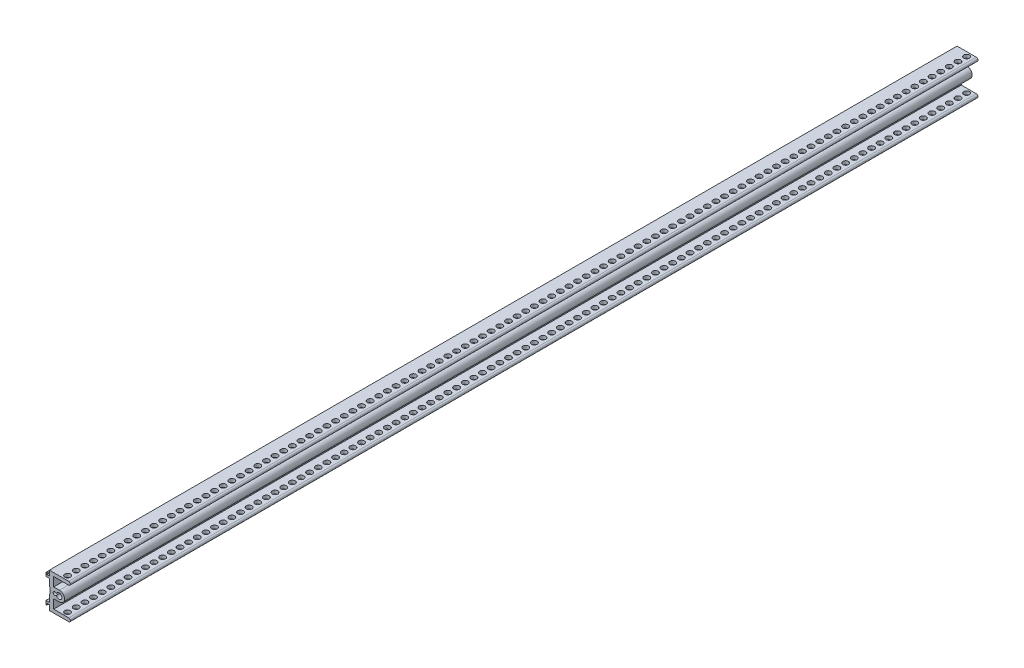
from build123d import *

# Parameters (mm, degrees)
EXTRUDE_1_DEPTH     = 266.7
SKETCH_3_R          = 1.65
CUT_EXTRUDE_1_DEPTH = 2.5


with BuildPart() as part:
    # Sketch 1 → Extrude 1 (new, symmetric)
    with BuildSketch(Plane.XY):
        with BuildLine():
            Line((-4.15, 8.3), (-4.15, 3))
            Line((-4.15, 3), (-0.75, 3))
            ThreePointArc((-0.75, 3), (2.25, 0), (-0.75, -3))
            Line((-0.75, -3), (-4.15, -3))
            Line((-4.15, -3), (-4.15, -8.3))
            Line((-4.15, -8.3), (4.65, -8.3))
            ThreePointArc((4.65, -8.3), (5.65, -9.3), (4.65, -10.3))
            Line((4.65, -10.3), (-6.65, -10.3))
            Line((-6.65, -10.3), (-6.65, -7.3))
            Line((-6.65, -7.3), (-8.05, -7.3))
            Line((-8.05, -7.3), (-8.05, -8.078245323))
            ThreePointArc((-8.05, -8.078245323), (-8.35, -8.378245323), (-8.65, -8.078245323))
            Line((-8.65, -8.078245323), (-8.65, -6.1))
            Line((-8.65, -6.1), (-6.65, -6.1))
            Line((-6.65, -6.1), (-6.65, -2.088438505))
            Line((-6.65, -2.088438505), (-6.35, -1.488438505))
            Line((-6.35, -1.488438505), (-6.35, 1.511561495))
            Line((-6.35, 1.511561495), (-6.65, 2.111561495))
            Line((-6.65, 2.111561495), (-6.65, 6.1))
            Line((-6.65, 6.1), (-8.65, 6.1))
            Line((-8.65, 6.1), (-8.65, 8.078245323))
            ThreePointArc((-8.65, 8.078245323), (-8.35, 8.378245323), (-8.05, 8.078245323))
            Line((-8.05, 8.078245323), (-8.05, 7.3))
            Line((-8.05, 7.3), (-6.65, 7.3))
            Line((-6.65, 7.3), (-6.65, 10.3))
            Line((-6.65, 10.3), (4.65, 10.3))
            ThreePointArc((4.65, 10.3), (5.65, 9.3), (4.65, 8.3))
            Line((4.65, 8.3), (-4.15, 8.3))
        make_face()
        with BuildLine():
            ThreePointArc((-2.5445, -0.424346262), (0.7, 0), (-2.5445, 0.424346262))
            ThreePointArc((-2.5445, 0.424346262), (-4.45, 0), (-2.5445, -0.424346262))
        make_face(mode=Mode.SUBTRACT)
    extrude(amount=EXTRUDE_1_DEPTH, both=True)

    # Sketch 3 → Cut-Extrude 1 (cut)
    with BuildSketch(Plane.XZ.offset(10.3)):
        with Locations((1.5, 264.16)):
            Circle(SKETCH_3_R)
        with Locations((1.5, 259.08)):
            Circle(SKETCH_3_R)
        with Locations((1.5, 254)):
            Circle(SKETCH_3_R)
        with Locations((1.5, 248.92)):
            Circle(SKETCH_3_R)
        with Locations((1.5, 243.84)):
            Circle(SKETCH_3_R)
        with Locations((1.5, 238.76)):
            Circle(SKETCH_3_R)
        with Locations((1.5, 233.68)):
            Circle(SKETCH_3_R)
        with Locations((1.5, 228.6)):
            Circle(SKETCH_3_R)
        with Locations((1.5, 223.52)):
            Circle(SKETCH_3_R)
        with Locations((1.5, 218.44)):
            Circle(SKETCH_3_R)
        with Locations((1.5, 213.36)):
            Circle(SKETCH_3_R)
        with Locations((1.5, 208.28)):
            Circle(SKETCH_3_R)
        with Locations((1.5, 203.2)):
            Circle(SKETCH_3_R)
        with Locations((1.5, 198.12)):
            Circle(SKETCH_3_R)
        with Locations((1.5, 193.04)):
            Circle(SKETCH_3_R)
        with Locations((1.5, 187.96)):
            Circle(SKETCH_3_R)
        with Locations((1.5, 182.88)):
            Circle(SKETCH_3_R)
        with Locations((1.5, 177.8)):
            Circle(SKETCH_3_R)
        with Locations((1.5, 172.72)):
            Circle(SKETCH_3_R)
        with Locations((1.5, 167.64)):
            Circle(SKETCH_3_R)
        with Locations((1.5, 162.56)):
            Circle(SKETCH_3_R)
        with Locations((1.5, 157.48)):
            Circle(SKETCH_3_R)
        with Locations((1.5, 152.4)):
            Circle(SKETCH_3_R)
        with Locations((1.5, 147.32)):
            Circle(SKETCH_3_R)
        with Locations((1.5, 142.24)):
            Circle(SKETCH_3_R)
        with Locations((1.5, 137.16)):
            Circle(SKETCH_3_R)
        with Locations((1.5, 132.08)):
            Circle(SKETCH_3_R)
        with Locations((1.5, 127)):
            Circle(SKETCH_3_R)
        with Locations((1.5, 121.92)):
            Circle(SKETCH_3_R)
        with Locations((1.5, 116.84)):
            Circle(SKETCH_3_R)
        with Locations((1.5, 111.76)):
            Circle(SKETCH_3_R)
        with Locations((1.5, 106.68)):
            Circle(SKETCH_3_R)
        with Locations((1.5, 101.6)):
            Circle(SKETCH_3_R)
        with Locations((1.5, 96.52)):
            Circle(SKETCH_3_R)
        with Locations((1.5, 91.44)):
            Circle(SKETCH_3_R)
        with Locations((1.5, 86.36)):
            Circle(SKETCH_3_R)
        with Locations((1.5, 81.28)):
            Circle(SKETCH_3_R)
        with Locations((1.5, 76.2)):
            Circle(SKETCH_3_R)
        with Locations((1.5, 71.12)):
            Circle(SKETCH_3_R)
        with Locations((1.5, 66.04)):
            Circle(SKETCH_3_R)
        with Locations((1.5, 60.96)):
            Circle(SKETCH_3_R)
        with Locations((1.5, 55.88)):
            Circle(SKETCH_3_R)
        with Locations((1.5, 50.8)):
            Circle(SKETCH_3_R)
        with Locations((1.5, 45.72)):
            Circle(SKETCH_3_R)
        with Locations((1.5, 40.64)):
            Circle(SKETCH_3_R)
        with Locations((1.5, 35.56)):
            Circle(SKETCH_3_R)
        with Locations((1.5, 30.48)):
            Circle(SKETCH_3_R)
        with Locations((1.5, 25.4)):
            Circle(SKETCH_3_R)
        with Locations((1.5, 20.32)):
            Circle(SKETCH_3_R)
        with Locations((1.5, 15.24)):
            Circle(SKETCH_3_R)
        with Locations((1.5, 10.16)):
            Circle(SKETCH_3_R)
        with Locations((1.5, 5.08)):
            Circle(SKETCH_3_R)
        with Locations((1.5, 0)):
            Circle(SKETCH_3_R)
        with Locations((1.5, -5.08)):
            Circle(SKETCH_3_R)
        with Locations((1.5, -10.16)):
            Circle(SKETCH_3_R)
        with Locations((1.5, -15.24)):
            Circle(SKETCH_3_R)
        with Locations((1.5, -20.32)):
            Circle(SKETCH_3_R)
        with Locations((1.5, -25.4)):
            Circle(SKETCH_3_R)
        with Locations((1.5, -30.48)):
            Circle(SKETCH_3_R)
        with Locations((1.5, -35.56)):
            Circle(SKETCH_3_R)
        with Locations((1.5, -40.64)):
            Circle(SKETCH_3_R)
        with Locations((1.5, -45.72)):
            Circle(SKETCH_3_R)
        with Locations((1.5, -50.8)):
            Circle(SKETCH_3_R)
        with Locations((1.5, -55.88)):
            Circle(SKETCH_3_R)
        with Locations((1.5, -60.96)):
            Circle(SKETCH_3_R)
        with Locations((1.5, -66.04)):
            Circle(SKETCH_3_R)
        with Locations((1.5, -71.12)):
            Circle(SKETCH_3_R)
        with Locations((1.5, -76.2)):
            Circle(SKETCH_3_R)
        with Locations((1.5, -81.28)):
            Circle(SKETCH_3_R)
        with Locations((1.5, -86.36)):
            Circle(SKETCH_3_R)
        with Locations((1.5, -91.44)):
            Circle(SKETCH_3_R)
        with Locations((1.5, -96.52)):
            Circle(SKETCH_3_R)
        with Locations((1.5, -101.6)):
            Circle(SKETCH_3_R)
        with Locations((1.5, -106.68)):
            Circle(SKETCH_3_R)
        with Locations((1.5, -111.76)):
            Circle(SKETCH_3_R)
        with Locations((1.5, -116.84)):
            Circle(SKETCH_3_R)
        with Locations((1.5, -121.92)):
            Circle(SKETCH_3_R)
        with Locations((1.5, -127)):
            Circle(SKETCH_3_R)
        with Locations((1.5, -132.08)):
            Circle(SKETCH_3_R)
        with Locations((1.5, -137.16)):
            Circle(SKETCH_3_R)
        with Locations((1.5, -142.24)):
            Circle(SKETCH_3_R)
        with Locations((1.5, -147.32)):
            Circle(SKETCH_3_R)
        with Locations((1.5, -152.4)):
            Circle(SKETCH_3_R)
        with Locations((1.5, -157.48)):
            Circle(SKETCH_3_R)
        with Locations((1.5, -162.56)):
            Circle(SKETCH_3_R)
        with Locations((1.5, -167.64)):
            Circle(SKETCH_3_R)
        with Locations((1.5, -172.72)):
            Circle(SKETCH_3_R)
        with Locations((1.5, -177.8)):
            Circle(SKETCH_3_R)
        with Locations((1.5, -182.88)):
            Circle(SKETCH_3_R)
        with Locations((1.5, -187.96)):
            Circle(SKETCH_3_R)
        with Locations((1.5, -193.04)):
            Circle(SKETCH_3_R)
        with Locations((1.5, -198.12)):
            Circle(SKETCH_3_R)
        with Locations((1.5, -203.2)):
            Circle(SKETCH_3_R)
        with Locations((1.5, -208.28)):
            Circle(SKETCH_3_R)
        with Locations((1.5, -213.36)):
            Circle(SKETCH_3_R)
        with Locations((1.5, -218.44)):
            Circle(SKETCH_3_R)
        with Locations((1.5, -223.52)):
            Circle(SKETCH_3_R)
        with Locations((1.5, -228.6)):
            Circle(SKETCH_3_R)
        with Locations((1.5, -233.68)):
            Circle(SKETCH_3_R)
        with Locations((1.5, -238.76)):
            Circle(SKETCH_3_R)
        with Locations((1.5, -243.84)):
            Circle(SKETCH_3_R)
        with Locations((1.5, -248.92)):
            Circle(SKETCH_3_R)
        with Locations((1.5, -254)):
            Circle(SKETCH_3_R)
        with Locations((1.5, -259.08)):
            Circle(SKETCH_3_R)
        with Locations((1.5, -264.16)):
            Circle(SKETCH_3_R)
    cut_extrude_1 = extrude(amount=-CUT_EXTRUDE_1_DEPTH, mode=Mode.SUBTRACT)

    # Mirror 1: Cut-Extrude 1 across plane
    add(cut_extrude_1.mirror(Plane.ZX), mode=Mode.SUBTRACT)


solid = part.part
